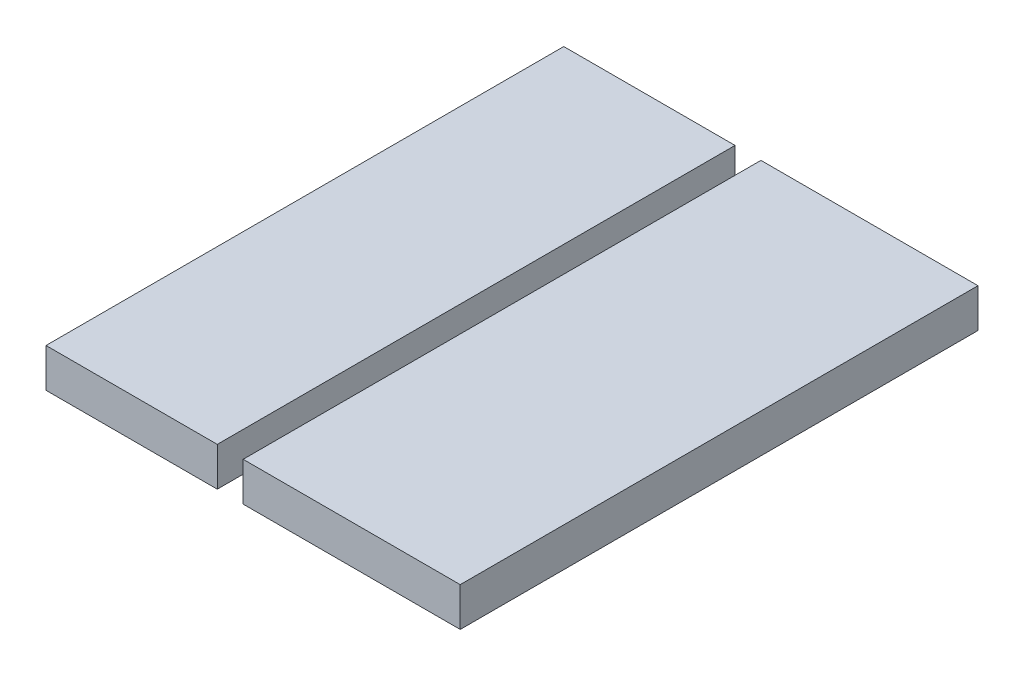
ISO-10303-21;
HEADER;
FILE_DESCRIPTION(('STEP AP214'),'2;1');
FILE_NAME('part.step','',(''),(''),'','','');
FILE_SCHEMA(('AUTOMOTIVE_DESIGN { 1 0 10303 214 1 1 1 1 }'));
ENDSEC;
DATA;
#1=APPLICATION_CONTEXT('core data for automotive mechanical design processes');
#2=APPLICATION_PROTOCOL_DEFINITION('international standard','automotive_design',2000,#1);
#3=PRODUCT_CONTEXT('',#1,'mechanical');
#4=PRODUCT('Part','Part','',(#3));
#5=PRODUCT_RELATED_PRODUCT_CATEGORY('part','',(#4));
#6=PRODUCT_DEFINITION_FORMATION('','',#4);
#7=PRODUCT_DEFINITION_CONTEXT('part definition',#1,'design');
#8=PRODUCT_DEFINITION('design','',#6,#7);
#9=PRODUCT_DEFINITION_SHAPE('','',#8);
#10=(LENGTH_UNIT() NAMED_UNIT(*) SI_UNIT(.MILLI.,.METRE.));
#11=(NAMED_UNIT(*) PLANE_ANGLE_UNIT() SI_UNIT($,.RADIAN.));
#12=(NAMED_UNIT(*) SI_UNIT($,.STERADIAN.) SOLID_ANGLE_UNIT());
#13=UNCERTAINTY_MEASURE_WITH_UNIT(LENGTH_MEASURE(1.E-05),#10,'distance_accuracy_value','');
#14=(GEOMETRIC_REPRESENTATION_CONTEXT(3) GLOBAL_UNCERTAINTY_ASSIGNED_CONTEXT((#13)) GLOBAL_UNIT_ASSIGNED_CONTEXT((#10,
#11,#12)) REPRESENTATION_CONTEXT('',''));
#15=CARTESIAN_POINT('',(0.,0.,0.));
#16=DIRECTION('',(0.,0.,1.));
#17=DIRECTION('',(1.,0.,0.));
#18=AXIS2_PLACEMENT_3D('',#15,#16,#17);
#19=CARTESIAN_POINT('',(-22.5914357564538,0.,-23.1048774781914));
#20=DIRECTION('',(-1.,0.,0.));
#21=DIRECTION('',(0.,0.,1.));
#22=AXIS2_PLACEMENT_3D('',#19,#20,#21);
#23=PLANE('',#22);
#24=DIRECTION('',(0.,0.,1.));
#25=VECTOR('',#24,1.);
#26=CARTESIAN_POINT('',(-22.5914357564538,4.7625,-23.1048774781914));
#27=LINE('',#26,#25);
#28=CARTESIAN_POINT('',(-22.5914357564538,4.7625,-23.1048774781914));
#29=VERTEX_POINT('',#28);
#30=CARTESIAN_POINT('',(-22.5914357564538,4.7625,40.3951225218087));
#31=VERTEX_POINT('',#30);
#32=EDGE_CURVE('E105',#29,#31,#27,.T.);
#33=ORIENTED_EDGE('',*,*,#32,.F.);
#34=DIRECTION('',(0.,1.,0.));
#35=VECTOR('',#34,1.);
#36=CARTESIAN_POINT('',(-22.5914357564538,0.,-23.1048774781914));
#37=LINE('',#36,#35);
#38=CARTESIAN_POINT('',(-22.5914357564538,0.,-23.1048774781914));
#39=VERTEX_POINT('',#38);
#40=EDGE_CURVE('E12',#39,#29,#37,.T.);
#41=ORIENTED_EDGE('',*,*,#40,.F.);
#42=DIRECTION('',(0.,0.,1.));
#43=VECTOR('',#42,1.);
#44=CARTESIAN_POINT('',(-22.5914357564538,0.,-23.1048774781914));
#45=LINE('',#44,#43);
#46=CARTESIAN_POINT('',(-22.5914357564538,0.,40.3951225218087));
#47=VERTEX_POINT('',#46);
#48=EDGE_CURVE('E99',#39,#47,#45,.T.);
#49=ORIENTED_EDGE('',*,*,#48,.T.);
#50=DIRECTION('',(0.,1.,0.));
#51=VECTOR('',#50,1.);
#52=CARTESIAN_POINT('',(-22.5914357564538,0.,40.3951225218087));
#53=LINE('',#52,#51);
#54=EDGE_CURVE('E44',#47,#31,#53,.T.);
#55=ORIENTED_EDGE('',*,*,#54,.T.);
#56=EDGE_LOOP('',(#33,#41,#49,#55));
#57=FACE_BOUND('',#56,.T.);
#58=ADVANCED_FACE('F41',(#57),#23,.T.);
#59=CARTESIAN_POINT('',(-1.5875,0.,-23.1048774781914));
#60=DIRECTION('',(0.,0.,-1.));
#61=DIRECTION('',(-1.,0.,0.));
#62=AXIS2_PLACEMENT_3D('',#59,#60,#61);
#63=PLANE('',#62);
#64=DIRECTION('',(-1.,0.,0.));
#65=VECTOR('',#64,1.);
#66=CARTESIAN_POINT('',(-1.5875,4.7625,-23.1048774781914));
#67=LINE('',#66,#65);
#68=CARTESIAN_POINT('',(-1.5875,4.7625,-23.1048774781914));
#69=VERTEX_POINT('',#68);
#70=EDGE_CURVE('E101',#69,#29,#67,.T.);
#71=ORIENTED_EDGE('',*,*,#70,.F.);
#72=DIRECTION('',(0.,1.,0.));
#73=VECTOR('',#72,1.);
#74=CARTESIAN_POINT('',(-1.5875,0.,-23.1048774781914));
#75=LINE('',#74,#73);
#76=CARTESIAN_POINT('',(-1.5875,0.,-23.1048774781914));
#77=VERTEX_POINT('',#76);
#78=EDGE_CURVE('E50',#77,#69,#75,.T.);
#79=ORIENTED_EDGE('',*,*,#78,.F.);
#80=DIRECTION('',(-1.,0.,0.));
#81=VECTOR('',#80,1.);
#82=CARTESIAN_POINT('',(-1.5875,0.,-23.1048774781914));
#83=LINE('',#82,#81);
#84=EDGE_CURVE('E96',#77,#39,#83,.T.);
#85=ORIENTED_EDGE('',*,*,#84,.T.);
#86=ORIENTED_EDGE('',*,*,#40,.T.);
#87=EDGE_LOOP('',(#71,#79,#85,#86));
#88=FACE_BOUND('',#87,.T.);
#89=ADVANCED_FACE('F115',(#88),#63,.T.);
#90=CARTESIAN_POINT('',(-1.5875,0.,40.3951225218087));
#91=DIRECTION('',(1.,0.,0.));
#92=DIRECTION('',(0.,0.,-1.));
#93=AXIS2_PLACEMENT_3D('',#90,#91,#92);
#94=PLANE('',#93);
#95=DIRECTION('',(0.,0.,-1.));
#96=VECTOR('',#95,1.);
#97=CARTESIAN_POINT('',(-1.5875,4.7625,40.3951225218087));
#98=LINE('',#97,#96);
#99=CARTESIAN_POINT('',(-1.5875,4.7625,40.3951225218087));
#100=VERTEX_POINT('',#99);
#101=EDGE_CURVE('E91',#100,#69,#98,.T.);
#102=ORIENTED_EDGE('',*,*,#101,.F.);
#103=DIRECTION('',(0.,1.,0.));
#104=VECTOR('',#103,1.);
#105=CARTESIAN_POINT('',(-1.5875,0.,40.3951225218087));
#106=LINE('',#105,#104);
#107=CARTESIAN_POINT('',(-1.5875,0.,40.3951225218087));
#108=VERTEX_POINT('',#107);
#109=EDGE_CURVE('E86',#108,#100,#106,.T.);
#110=ORIENTED_EDGE('',*,*,#109,.F.);
#111=DIRECTION('',(0.,0.,-1.));
#112=VECTOR('',#111,1.);
#113=CARTESIAN_POINT('',(-1.5875,0.,40.3951225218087));
#114=LINE('',#113,#112);
#115=EDGE_CURVE('E89',#108,#77,#114,.T.);
#116=ORIENTED_EDGE('',*,*,#115,.T.);
#117=ORIENTED_EDGE('',*,*,#78,.T.);
#118=EDGE_LOOP('',(#102,#110,#116,#117));
#119=FACE_BOUND('',#118,.T.);
#120=ADVANCED_FACE('F88',(#119),#94,.T.);
#121=CARTESIAN_POINT('',(-22.5914357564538,0.,40.3951225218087));
#122=DIRECTION('',(0.,0.,1.));
#123=DIRECTION('',(1.,0.,0.));
#124=AXIS2_PLACEMENT_3D('',#121,#122,#123);
#125=PLANE('',#124);
#126=DIRECTION('',(1.,0.,0.));
#127=VECTOR('',#126,1.);
#128=CARTESIAN_POINT('',(-22.5914357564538,4.7625,40.3951225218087));
#129=LINE('',#128,#127);
#130=EDGE_CURVE('E108',#31,#100,#129,.T.);
#131=ORIENTED_EDGE('',*,*,#130,.F.);
#132=ORIENTED_EDGE('',*,*,#54,.F.);
#133=DIRECTION('',(1.,0.,0.));
#134=VECTOR('',#133,1.);
#135=CARTESIAN_POINT('',(-22.5914357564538,0.,40.3951225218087));
#136=LINE('',#135,#134);
#137=EDGE_CURVE('E95',#47,#108,#136,.T.);
#138=ORIENTED_EDGE('',*,*,#137,.T.);
#139=ORIENTED_EDGE('',*,*,#109,.T.);
#140=EDGE_LOOP('',(#131,#132,#138,#139));
#141=FACE_BOUND('',#140,.T.);
#142=ADVANCED_FACE('F98',(#141),#125,.T.);
#143=CARTESIAN_POINT('',(-22.5914357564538,0.,40.3951225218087));
#144=DIRECTION('',(0.,1.,0.));
#145=DIRECTION('',(0.,0.,1.));
#146=AXIS2_PLACEMENT_3D('',#143,#144,#145);
#147=PLANE('',#146);
#148=ORIENTED_EDGE('',*,*,#48,.F.);
#149=ORIENTED_EDGE('',*,*,#84,.F.);
#150=ORIENTED_EDGE('',*,*,#115,.F.);
#151=ORIENTED_EDGE('',*,*,#137,.F.);
#152=EDGE_LOOP('',(#148,#149,#150,#151));
#153=FACE_BOUND('',#152,.T.);
#154=ADVANCED_FACE('F94',(#153),#147,.F.);
#155=CARTESIAN_POINT('',(-22.5914357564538,4.7625,40.3951225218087));
#156=DIRECTION('',(0.,1.,0.));
#157=DIRECTION('',(0.,0.,1.));
#158=AXIS2_PLACEMENT_3D('',#155,#156,#157);
#159=PLANE('',#158);
#160=ORIENTED_EDGE('',*,*,#32,.T.);
#161=ORIENTED_EDGE('',*,*,#130,.T.);
#162=ORIENTED_EDGE('',*,*,#101,.T.);
#163=ORIENTED_EDGE('',*,*,#70,.T.);
#164=EDGE_LOOP('',(#160,#161,#162,#163));
#165=FACE_BOUND('',#164,.T.);
#166=ADVANCED_FACE('F114',(#165),#159,.T.);
#167=CLOSED_SHELL('',(#58,#89,#120,#142,#154,#166));
#168=MANIFOLD_SOLID_BREP('B2',#167);
#169=CARTESIAN_POINT('',(28.2085642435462,4.7625,40.3951225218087));
#170=DIRECTION('',(0.,0.,1.));
#171=DIRECTION('',(1.,0.,0.));
#172=AXIS2_PLACEMENT_3D('',#169,#170,#171);
#173=PLANE('',#172);
#174=DIRECTION('',(-1.,0.,0.));
#175=VECTOR('',#174,1.);
#176=CARTESIAN_POINT('',(28.2085642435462,0.,40.3951225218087));
#177=LINE('',#176,#175);
#178=CARTESIAN_POINT('',(28.2085642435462,0.,40.3951225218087));
#179=VERTEX_POINT('',#178);
#180=CARTESIAN_POINT('',(1.5875,0.,40.3951225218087));
#181=VERTEX_POINT('',#180);
#182=EDGE_CURVE('E229',#179,#181,#177,.T.);
#183=ORIENTED_EDGE('',*,*,#182,.F.);
#184=DIRECTION('',(0.,-1.,0.));
#185=VECTOR('',#184,1.);
#186=CARTESIAN_POINT('',(28.2085642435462,4.7625,40.3951225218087));
#187=LINE('',#186,#185);
#188=CARTESIAN_POINT('',(28.2085642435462,4.7625,40.3951225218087));
#189=VERTEX_POINT('',#188);
#190=EDGE_CURVE('E39',#189,#179,#187,.T.);
#191=ORIENTED_EDGE('',*,*,#190,.F.);
#192=DIRECTION('',(-1.,0.,0.));
#193=VECTOR('',#192,1.);
#194=CARTESIAN_POINT('',(28.2085642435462,4.7625,40.3951225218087));
#195=LINE('',#194,#193);
#196=CARTESIAN_POINT('',(1.5875,4.7625,40.3951225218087));
#197=VERTEX_POINT('',#196);
#198=EDGE_CURVE('E223',#189,#197,#195,.T.);
#199=ORIENTED_EDGE('',*,*,#198,.T.);
#200=DIRECTION('',(0.,-1.,0.));
#201=VECTOR('',#200,1.);
#202=CARTESIAN_POINT('',(1.5875,4.7625,40.3951225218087));
#203=LINE('',#202,#201);
#204=EDGE_CURVE('E168',#197,#181,#203,.T.);
#205=ORIENTED_EDGE('',*,*,#204,.T.);
#206=EDGE_LOOP('',(#183,#191,#199,#205));
#207=FACE_BOUND('',#206,.T.);
#208=ADVANCED_FACE('F165',(#207),#173,.T.);
#209=CARTESIAN_POINT('',(28.2085642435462,4.7625,-23.1048774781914));
#210=DIRECTION('',(1.,0.,0.));
#211=DIRECTION('',(0.,0.,-1.));
#212=AXIS2_PLACEMENT_3D('',#209,#210,#211);
#213=PLANE('',#212);
#214=DIRECTION('',(0.,0.,1.));
#215=VECTOR('',#214,1.);
#216=CARTESIAN_POINT('',(28.2085642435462,0.,-23.1048774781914));
#217=LINE('',#216,#215);
#218=CARTESIAN_POINT('',(28.2085642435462,0.,-23.1048774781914));
#219=VERTEX_POINT('',#218);
#220=EDGE_CURVE('E225',#219,#179,#217,.T.);
#221=ORIENTED_EDGE('',*,*,#220,.F.);
#222=DIRECTION('',(0.,-1.,0.));
#223=VECTOR('',#222,1.);
#224=CARTESIAN_POINT('',(28.2085642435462,4.7625,-23.1048774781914));
#225=LINE('',#224,#223);
#226=CARTESIAN_POINT('',(28.2085642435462,4.7625,-23.1048774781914));
#227=VERTEX_POINT('',#226);
#228=EDGE_CURVE('E174',#227,#219,#225,.T.);
#229=ORIENTED_EDGE('',*,*,#228,.F.);
#230=DIRECTION('',(0.,0.,1.));
#231=VECTOR('',#230,1.);
#232=CARTESIAN_POINT('',(28.2085642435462,4.7625,-23.1048774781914));
#233=LINE('',#232,#231);
#234=EDGE_CURVE('E220',#227,#189,#233,.T.);
#235=ORIENTED_EDGE('',*,*,#234,.T.);
#236=ORIENTED_EDGE('',*,*,#190,.T.);
#237=EDGE_LOOP('',(#221,#229,#235,#236));
#238=FACE_BOUND('',#237,.T.);
#239=ADVANCED_FACE('F239',(#238),#213,.T.);
#240=CARTESIAN_POINT('',(1.5875,4.7625,-23.1048774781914));
#241=DIRECTION('',(0.,0.,-1.));
#242=DIRECTION('',(-1.,0.,0.));
#243=AXIS2_PLACEMENT_3D('',#240,#241,#242);
#244=PLANE('',#243);
#245=DIRECTION('',(1.,0.,0.));
#246=VECTOR('',#245,1.);
#247=CARTESIAN_POINT('',(1.5875,0.,-23.1048774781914));
#248=LINE('',#247,#246);
#249=CARTESIAN_POINT('',(1.5875,0.,-23.1048774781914));
#250=VERTEX_POINT('',#249);
#251=EDGE_CURVE('E215',#250,#219,#248,.T.);
#252=ORIENTED_EDGE('',*,*,#251,.F.);
#253=DIRECTION('',(0.,-1.,0.));
#254=VECTOR('',#253,1.);
#255=CARTESIAN_POINT('',(1.5875,4.7625,-23.1048774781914));
#256=LINE('',#255,#254);
#257=CARTESIAN_POINT('',(1.5875,4.7625,-23.1048774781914));
#258=VERTEX_POINT('',#257);
#259=EDGE_CURVE('E210',#258,#250,#256,.T.);
#260=ORIENTED_EDGE('',*,*,#259,.F.);
#261=DIRECTION('',(1.,0.,0.));
#262=VECTOR('',#261,1.);
#263=CARTESIAN_POINT('',(1.5875,4.7625,-23.1048774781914));
#264=LINE('',#263,#262);
#265=EDGE_CURVE('E213',#258,#227,#264,.T.);
#266=ORIENTED_EDGE('',*,*,#265,.T.);
#267=ORIENTED_EDGE('',*,*,#228,.T.);
#268=EDGE_LOOP('',(#252,#260,#266,#267));
#269=FACE_BOUND('',#268,.T.);
#270=ADVANCED_FACE('F212',(#269),#244,.T.);
#271=CARTESIAN_POINT('',(1.5875,4.7625,40.3951225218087));
#272=DIRECTION('',(-1.,0.,0.));
#273=DIRECTION('',(0.,0.,1.));
#274=AXIS2_PLACEMENT_3D('',#271,#272,#273);
#275=PLANE('',#274);
#276=DIRECTION('',(0.,0.,-1.));
#277=VECTOR('',#276,1.);
#278=CARTESIAN_POINT('',(1.5875,0.,40.3951225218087));
#279=LINE('',#278,#277);
#280=EDGE_CURVE('E232',#181,#250,#279,.T.);
#281=ORIENTED_EDGE('',*,*,#280,.F.);
#282=ORIENTED_EDGE('',*,*,#204,.F.);
#283=DIRECTION('',(0.,0.,-1.));
#284=VECTOR('',#283,1.);
#285=CARTESIAN_POINT('',(1.5875,4.7625,40.3951225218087));
#286=LINE('',#285,#284);
#287=EDGE_CURVE('E219',#197,#258,#286,.T.);
#288=ORIENTED_EDGE('',*,*,#287,.T.);
#289=ORIENTED_EDGE('',*,*,#259,.T.);
#290=EDGE_LOOP('',(#281,#282,#288,#289));
#291=FACE_BOUND('',#290,.T.);
#292=ADVANCED_FACE('F222',(#291),#275,.T.);
#293=CARTESIAN_POINT('',(1.5875,4.7625,40.3951225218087));
#294=DIRECTION('',(0.,-1.,0.));
#295=DIRECTION('',(0.,0.,-1.));
#296=AXIS2_PLACEMENT_3D('',#293,#294,#295);
#297=PLANE('',#296);
#298=ORIENTED_EDGE('',*,*,#198,.F.);
#299=ORIENTED_EDGE('',*,*,#234,.F.);
#300=ORIENTED_EDGE('',*,*,#265,.F.);
#301=ORIENTED_EDGE('',*,*,#287,.F.);
#302=EDGE_LOOP('',(#298,#299,#300,#301));
#303=FACE_BOUND('',#302,.T.);
#304=ADVANCED_FACE('F218',(#303),#297,.F.);
#305=CARTESIAN_POINT('',(1.5875,0.,40.3951225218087));
#306=DIRECTION('',(0.,-1.,0.));
#307=DIRECTION('',(0.,0.,-1.));
#308=AXIS2_PLACEMENT_3D('',#305,#306,#307);
#309=PLANE('',#308);
#310=ORIENTED_EDGE('',*,*,#182,.T.);
#311=ORIENTED_EDGE('',*,*,#280,.T.);
#312=ORIENTED_EDGE('',*,*,#251,.T.);
#313=ORIENTED_EDGE('',*,*,#220,.T.);
#314=EDGE_LOOP('',(#310,#311,#312,#313));
#315=FACE_BOUND('',#314,.T.);
#316=ADVANCED_FACE('F238',(#315),#309,.T.);
#317=CLOSED_SHELL('',(#208,#239,#270,#292,#304,#316));
#318=MANIFOLD_SOLID_BREP('B6',#317);
#319=ADVANCED_BREP_SHAPE_REPRESENTATION('',(#18,#168,#318),#14);
#320=SHAPE_DEFINITION_REPRESENTATION(#9,#319);
ENDSEC;
END-ISO-10303-21;
